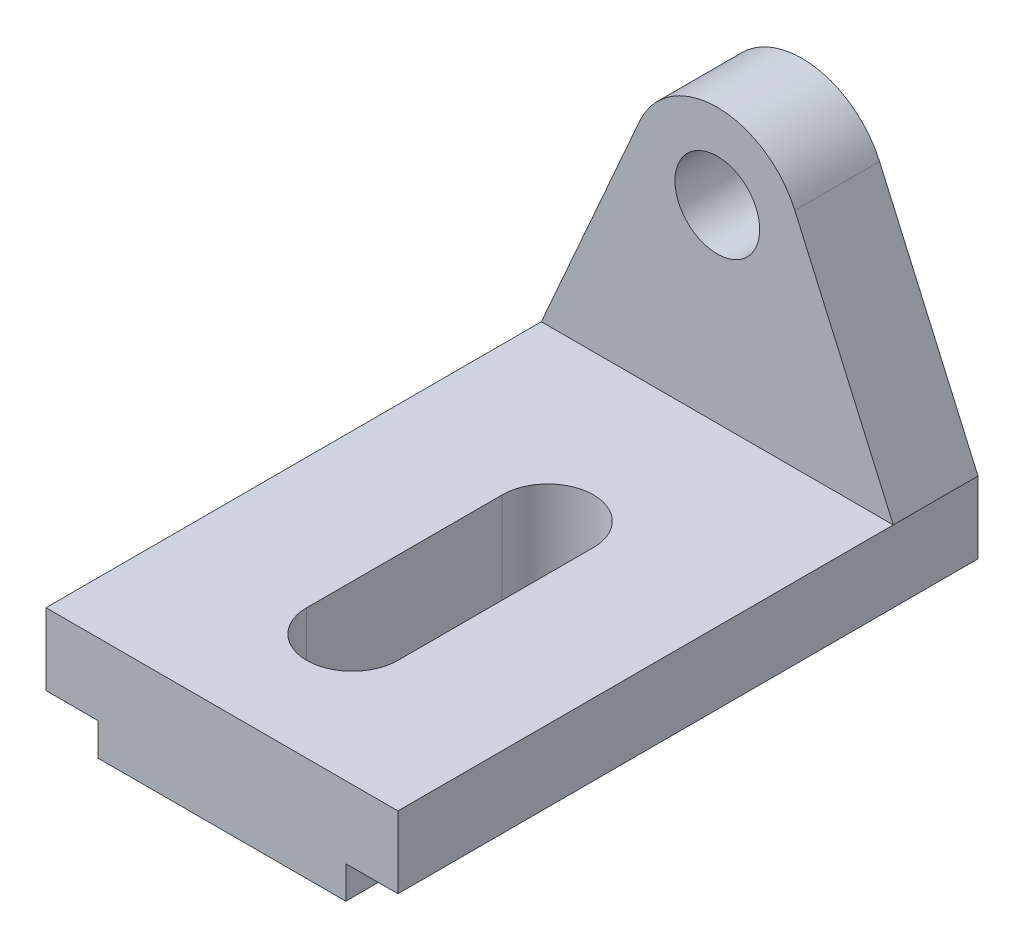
ISO-10303-21;
HEADER;
FILE_DESCRIPTION(('STEP AP214'),'2;1');
FILE_NAME('part.step','',(''),(''),'','','');
FILE_SCHEMA(('AUTOMOTIVE_DESIGN { 1 0 10303 214 1 1 1 1 }'));
ENDSEC;
DATA;
#1=APPLICATION_CONTEXT('core data for automotive mechanical design processes');
#2=APPLICATION_PROTOCOL_DEFINITION('international standard','automotive_design',2000,#1);
#3=PRODUCT_CONTEXT('',#1,'mechanical');
#4=PRODUCT('Part','Part','',(#3));
#5=PRODUCT_RELATED_PRODUCT_CATEGORY('part','',(#4));
#6=PRODUCT_DEFINITION_FORMATION('','',#4);
#7=PRODUCT_DEFINITION_CONTEXT('part definition',#1,'design');
#8=PRODUCT_DEFINITION('design','',#6,#7);
#9=PRODUCT_DEFINITION_SHAPE('','',#8);
#10=(LENGTH_UNIT() NAMED_UNIT(*) SI_UNIT(.MILLI.,.METRE.));
#11=(NAMED_UNIT(*) PLANE_ANGLE_UNIT() SI_UNIT($,.RADIAN.));
#12=(NAMED_UNIT(*) SI_UNIT($,.STERADIAN.) SOLID_ANGLE_UNIT());
#13=UNCERTAINTY_MEASURE_WITH_UNIT(LENGTH_MEASURE(1.E-05),#10,'distance_accuracy_value','');
#14=(GEOMETRIC_REPRESENTATION_CONTEXT(3) GLOBAL_UNCERTAINTY_ASSIGNED_CONTEXT((#13)) GLOBAL_UNIT_ASSIGNED_CONTEXT((#10,
#11,#12)) REPRESENTATION_CONTEXT('',''));
#15=CARTESIAN_POINT('',(0.,0.,0.));
#16=DIRECTION('',(0.,0.,1.));
#17=DIRECTION('',(1.,0.,0.));
#18=AXIS2_PLACEMENT_3D('',#15,#16,#17);
#19=CARTESIAN_POINT('',(0.,0.,89.));
#20=DIRECTION('',(0.,-1.,0.));
#21=DIRECTION('',(0.,0.,-1.));
#22=AXIS2_PLACEMENT_3D('',#19,#20,#21);
#23=PLANE('',#22);
#24=CARTESIAN_POINT('',(27.,0.,69.));
#25=DIRECTION('',(0.,1.,0.));
#26=DIRECTION('',(0.,0.,1.));
#27=AXIS2_PLACEMENT_3D('',#24,#25,#26);
#28=CIRCLE('',#27,7.00000000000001);
#29=CARTESIAN_POINT('',(20.,0.,69.));
#30=VERTEX_POINT('',#29);
#31=CARTESIAN_POINT('',(34.,0.,69.));
#32=VERTEX_POINT('',#31);
#33=EDGE_CURVE('E162',#30,#32,#28,.T.);
#34=ORIENTED_EDGE('',*,*,#33,.F.);
#35=DIRECTION('',(0.,0.,1.));
#36=VECTOR('',#35,1.);
#37=CARTESIAN_POINT('',(20.,0.,0.));
#38=LINE('',#37,#36);
#39=CARTESIAN_POINT('',(20.,0.,39.));
#40=VERTEX_POINT('',#39);
#41=EDGE_CURVE('E58',#40,#30,#38,.T.);
#42=ORIENTED_EDGE('',*,*,#41,.F.);
#43=CARTESIAN_POINT('',(27.,0.,39.));
#44=DIRECTION('',(0.,1.,0.));
#45=DIRECTION('',(0.,0.,1.));
#46=AXIS2_PLACEMENT_3D('',#43,#44,#45);
#47=CIRCLE('',#46,7.);
#48=CARTESIAN_POINT('',(34.,0.,39.));
#49=VERTEX_POINT('',#48);
#50=EDGE_CURVE('E168',#49,#40,#47,.T.);
#51=ORIENTED_EDGE('',*,*,#50,.F.);
#52=DIRECTION('',(0.,0.,1.));
#53=VECTOR('',#52,1.);
#54=CARTESIAN_POINT('',(34.,0.,0.));
#55=LINE('',#54,#53);
#56=EDGE_CURVE('E153',#49,#32,#55,.T.);
#57=ORIENTED_EDGE('',*,*,#56,.T.);
#58=EDGE_LOOP('',(#34,#42,#51,#57));
#59=FACE_BOUND('',#58,.T.);
#60=DIRECTION('',(1.,0.,0.));
#61=VECTOR('',#60,1.);
#62=CARTESIAN_POINT('',(0.,0.,13.));
#63=LINE('',#62,#61);
#64=CARTESIAN_POINT('',(0.,0.,13.));
#65=VERTEX_POINT('',#64);
#66=CARTESIAN_POINT('',(54.,0.,13.));
#67=VERTEX_POINT('',#66);
#68=EDGE_CURVE('E185',#65,#67,#63,.T.);
#69=ORIENTED_EDGE('',*,*,#68,.F.);
#70=DIRECTION('',(0.,0.,-1.));
#71=VECTOR('',#70,1.);
#72=CARTESIAN_POINT('',(0.,0.,89.));
#73=LINE('',#72,#71);
#74=CARTESIAN_POINT('',(0.,0.,89.));
#75=VERTEX_POINT('',#74);
#76=EDGE_CURVE('E262',#75,#65,#73,.T.);
#77=ORIENTED_EDGE('',*,*,#76,.F.);
#78=DIRECTION('',(-1.,0.,0.));
#79=VECTOR('',#78,1.);
#80=CARTESIAN_POINT('',(0.,0.,89.));
#81=LINE('',#80,#79);
#82=CARTESIAN_POINT('',(54.,0.,89.));
#83=VERTEX_POINT('',#82);
#84=EDGE_CURVE('E260',#83,#75,#81,.T.);
#85=ORIENTED_EDGE('',*,*,#84,.F.);
#86=DIRECTION('',(0.,0.,-1.));
#87=VECTOR('',#86,1.);
#88=CARTESIAN_POINT('',(54.,0.,89.));
#89=LINE('',#88,#87);
#90=EDGE_CURVE('E271',#83,#67,#89,.T.);
#91=ORIENTED_EDGE('',*,*,#90,.T.);
#92=EDGE_LOOP('',(#69,#77,#85,#91));
#93=FACE_BOUND('',#92,.T.);
#94=ADVANCED_FACE('F43',(#59,#93),#23,.F.);
#95=CARTESIAN_POINT('',(0.,-16.,89.));
#96=DIRECTION('',(0.,1.,0.));
#97=DIRECTION('',(0.,0.,1.));
#98=AXIS2_PLACEMENT_3D('',#95,#96,#97);
#99=PLANE('',#98);
#100=CARTESIAN_POINT('',(27.,-16.,39.));
#101=DIRECTION('',(0.,1.,0.));
#102=DIRECTION('',(0.,0.,1.));
#103=AXIS2_PLACEMENT_3D('',#100,#101,#102);
#104=CIRCLE('',#103,7.);
#105=CARTESIAN_POINT('',(34.,-16.,39.));
#106=VERTEX_POINT('',#105);
#107=CARTESIAN_POINT('',(20.,-16.,39.));
#108=VERTEX_POINT('',#107);
#109=EDGE_CURVE('E51',#106,#108,#104,.T.);
#110=ORIENTED_EDGE('',*,*,#109,.T.);
#111=DIRECTION('',(0.,0.,1.));
#112=VECTOR('',#111,1.);
#113=CARTESIAN_POINT('',(20.,-16.,89.));
#114=LINE('',#113,#112);
#115=CARTESIAN_POINT('',(20.,-16.,69.));
#116=VERTEX_POINT('',#115);
#117=EDGE_CURVE('E11',#108,#116,#114,.T.);
#118=ORIENTED_EDGE('',*,*,#117,.T.);
#119=CARTESIAN_POINT('',(27.,-16.,69.));
#120=DIRECTION('',(0.,1.,0.));
#121=DIRECTION('',(0.,0.,1.));
#122=AXIS2_PLACEMENT_3D('',#119,#120,#121);
#123=CIRCLE('',#122,7.00000000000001);
#124=CARTESIAN_POINT('',(34.,-16.,69.));
#125=VERTEX_POINT('',#124);
#126=EDGE_CURVE('E273',#116,#125,#123,.T.);
#127=ORIENTED_EDGE('',*,*,#126,.T.);
#128=DIRECTION('',(0.,0.,1.));
#129=VECTOR('',#128,1.);
#130=CARTESIAN_POINT('',(34.,-16.,89.));
#131=LINE('',#130,#129);
#132=EDGE_CURVE('E156',#106,#125,#131,.T.);
#133=ORIENTED_EDGE('',*,*,#132,.F.);
#134=EDGE_LOOP('',(#110,#118,#127,#133));
#135=FACE_BOUND('',#134,.T.);
#136=DIRECTION('',(1.,0.,0.));
#137=VECTOR('',#136,1.);
#138=CARTESIAN_POINT('',(0.,-16.,89.));
#139=LINE('',#138,#137);
#140=CARTESIAN_POINT('',(8.,-16.,89.));
#141=VERTEX_POINT('',#140);
#142=CARTESIAN_POINT('',(46.,-16.,89.));
#143=VERTEX_POINT('',#142);
#144=EDGE_CURVE('E254',#141,#143,#139,.T.);
#145=ORIENTED_EDGE('',*,*,#144,.F.);
#146=DIRECTION('',(0.,0.,1.));
#147=VECTOR('',#146,1.);
#148=CARTESIAN_POINT('',(8.,-16.,0.));
#149=LINE('',#148,#147);
#150=CARTESIAN_POINT('',(8.,-16.,0.));
#151=VERTEX_POINT('',#150);
#152=EDGE_CURVE('E221',#151,#141,#149,.T.);
#153=ORIENTED_EDGE('',*,*,#152,.F.);
#154=DIRECTION('',(1.,0.,0.));
#155=VECTOR('',#154,1.);
#156=CARTESIAN_POINT('',(0.,-16.,0.));
#157=LINE('',#156,#155);
#158=CARTESIAN_POINT('',(46.,-16.,0.));
#159=VERTEX_POINT('',#158);
#160=EDGE_CURVE('E265',#151,#159,#157,.T.);
#161=ORIENTED_EDGE('',*,*,#160,.T.);
#162=DIRECTION('',(0.,0.,1.));
#163=VECTOR('',#162,1.);
#164=CARTESIAN_POINT('',(46.,-16.,0.));
#165=LINE('',#164,#163);
#166=EDGE_CURVE('E240',#159,#143,#165,.T.);
#167=ORIENTED_EDGE('',*,*,#166,.T.);
#168=EDGE_LOOP('',(#145,#153,#161,#167));
#169=FACE_BOUND('',#168,.T.);
#170=ADVANCED_FACE('F277',(#135,#169),#99,.F.);
#171=CARTESIAN_POINT('',(54.,0.,89.));
#172=DIRECTION('',(-1.,0.,0.));
#173=DIRECTION('',(0.,-1.,0.));
#174=AXIS2_PLACEMENT_3D('',#171,#172,#173);
#175=PLANE('',#174);
#176=DIRECTION('',(0.,0.,1.));
#177=VECTOR('',#176,1.);
#178=CARTESIAN_POINT('',(54.,-11.0111974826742,0.));
#179=LINE('',#178,#177);
#180=CARTESIAN_POINT('',(54.,-11.0111974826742,0.));
#181=VERTEX_POINT('',#180);
#182=CARTESIAN_POINT('',(54.,-11.0111974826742,89.));
#183=VERTEX_POINT('',#182);
#184=EDGE_CURVE('E247',#181,#183,#179,.T.);
#185=ORIENTED_EDGE('',*,*,#184,.F.);
#186=DIRECTION('',(0.,1.,0.));
#187=VECTOR('',#186,1.);
#188=CARTESIAN_POINT('',(54.,0.,0.));
#189=LINE('',#188,#187);
#190=CARTESIAN_POINT('',(54.,0.,0.));
#191=VERTEX_POINT('',#190);
#192=EDGE_CURVE('E255',#181,#191,#189,.T.);
#193=ORIENTED_EDGE('',*,*,#192,.T.);
#194=DIRECTION('',(0.,0.,-1.));
#195=VECTOR('',#194,1.);
#196=CARTESIAN_POINT('',(54.,0.,13.));
#197=LINE('',#196,#195);
#198=EDGE_CURVE('E194',#67,#191,#197,.T.);
#199=ORIENTED_EDGE('',*,*,#198,.F.);
#200=ORIENTED_EDGE('',*,*,#90,.F.);
#201=DIRECTION('',(0.,1.,0.));
#202=VECTOR('',#201,1.);
#203=CARTESIAN_POINT('',(54.,0.,89.));
#204=LINE('',#203,#202);
#205=EDGE_CURVE('E258',#183,#83,#204,.T.);
#206=ORIENTED_EDGE('',*,*,#205,.F.);
#207=EDGE_LOOP('',(#185,#193,#199,#200,#206));
#208=FACE_BOUND('',#207,.T.);
#209=ADVANCED_FACE('F301',(#208),#175,.F.);
#210=CARTESIAN_POINT('',(0.,0.,89.));
#211=DIRECTION('',(0.,0.,1.));
#212=DIRECTION('',(1.,0.,0.));
#213=AXIS2_PLACEMENT_3D('',#210,#211,#212);
#214=PLANE('',#213);
#215=DIRECTION('',(-1.,0.,0.));
#216=VECTOR('',#215,1.);
#217=CARTESIAN_POINT('',(0.,-11.0111974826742,89.));
#218=LINE('',#217,#216);
#219=CARTESIAN_POINT('',(8.,-11.0111974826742,89.));
#220=VERTEX_POINT('',#219);
#221=CARTESIAN_POINT('',(0.,-11.0111974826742,89.));
#222=VERTEX_POINT('',#221);
#223=EDGE_CURVE('E218',#220,#222,#218,.T.);
#224=ORIENTED_EDGE('',*,*,#223,.F.);
#225=DIRECTION('',(0.,1.,0.));
#226=VECTOR('',#225,1.);
#227=CARTESIAN_POINT('',(8.,0.,89.));
#228=LINE('',#227,#226);
#229=EDGE_CURVE('E222',#141,#220,#228,.T.);
#230=ORIENTED_EDGE('',*,*,#229,.F.);
#231=ORIENTED_EDGE('',*,*,#144,.T.);
#232=DIRECTION('',(0.,1.,0.));
#233=VECTOR('',#232,1.);
#234=CARTESIAN_POINT('',(46.,0.,89.));
#235=LINE('',#234,#233);
#236=CARTESIAN_POINT('',(46.,-11.0111974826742,89.));
#237=VERTEX_POINT('',#236);
#238=EDGE_CURVE('E207',#143,#237,#235,.T.);
#239=ORIENTED_EDGE('',*,*,#238,.T.);
#240=DIRECTION('',(1.,0.,0.));
#241=VECTOR('',#240,1.);
#242=CARTESIAN_POINT('',(0.,-11.0111974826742,89.));
#243=LINE('',#242,#241);
#244=EDGE_CURVE('E238',#237,#183,#243,.T.);
#245=ORIENTED_EDGE('',*,*,#244,.T.);
#246=ORIENTED_EDGE('',*,*,#205,.T.);
#247=ORIENTED_EDGE('',*,*,#84,.T.);
#248=DIRECTION('',(0.,-1.,0.));
#249=VECTOR('',#248,1.);
#250=CARTESIAN_POINT('',(0.,0.,89.));
#251=LINE('',#250,#249);
#252=EDGE_CURVE('E251',#75,#222,#251,.T.);
#253=ORIENTED_EDGE('',*,*,#252,.T.);
#254=EDGE_LOOP('',(#224,#230,#231,#239,#245,#246,#247,#253));
#255=FACE_BOUND('',#254,.T.);
#256=ADVANCED_FACE('F307',(#255),#214,.T.);
#257=CARTESIAN_POINT('',(0.,0.,0.));
#258=DIRECTION('',(0.,0.,1.));
#259=DIRECTION('',(1.,0.,0.));
#260=AXIS2_PLACEMENT_3D('',#257,#258,#259);
#261=PLANE('',#260);
#262=DIRECTION('',(0.,1.,0.));
#263=VECTOR('',#262,1.);
#264=CARTESIAN_POINT('',(8.,0.,0.));
#265=LINE('',#264,#263);
#266=CARTESIAN_POINT('',(8.,-11.0111974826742,0.));
#267=VERTEX_POINT('',#266);
#268=EDGE_CURVE('E214',#151,#267,#265,.T.);
#269=ORIENTED_EDGE('',*,*,#268,.T.);
#270=DIRECTION('',(-1.,0.,0.));
#271=VECTOR('',#270,1.);
#272=CARTESIAN_POINT('',(0.,-11.0111974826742,0.));
#273=LINE('',#272,#271);
#274=CARTESIAN_POINT('',(0.,-11.0111974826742,0.));
#275=VERTEX_POINT('',#274);
#276=EDGE_CURVE('E217',#267,#275,#273,.T.);
#277=ORIENTED_EDGE('',*,*,#276,.T.);
#278=DIRECTION('',(0.,-1.,0.));
#279=VECTOR('',#278,1.);
#280=CARTESIAN_POINT('',(0.,0.,0.));
#281=LINE('',#280,#279);
#282=CARTESIAN_POINT('',(0.,0.,0.));
#283=VERTEX_POINT('',#282);
#284=EDGE_CURVE('E230',#283,#275,#281,.T.);
#285=ORIENTED_EDGE('',*,*,#284,.F.);
#286=DIRECTION('',(0.403572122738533,0.91494783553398,0.));
#287=VECTOR('',#286,1.);
#288=CARTESIAN_POINT('',(0.,0.,0.));
#289=LINE('',#288,#287);
#290=CARTESIAN_POINT('',(15.1056781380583,34.2464375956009,0.));
#291=VERTEX_POINT('',#290);
#292=EDGE_CURVE('E200',#283,#291,#289,.T.);
#293=ORIENTED_EDGE('',*,*,#292,.T.);
#294=CARTESIAN_POINT('',(27.,29.,0.));
#295=DIRECTION('',(0.,0.,-1.));
#296=DIRECTION('',(-1.,0.,0.));
#297=AXIS2_PLACEMENT_3D('',#294,#295,#296);
#298=CIRCLE('',#297,13.);
#299=CARTESIAN_POINT('',(38.8943218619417,34.2464375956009,0.));
#300=VERTEX_POINT('',#299);
#301=EDGE_CURVE('E182',#291,#300,#298,.T.);
#302=ORIENTED_EDGE('',*,*,#301,.T.);
#303=DIRECTION('',(0.403572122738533,-0.91494783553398,0.));
#304=VECTOR('',#303,1.);
#305=CARTESIAN_POINT('',(45.204995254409,19.9393617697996,0.));
#306=LINE('',#305,#304);
#307=EDGE_CURVE('E197',#300,#191,#306,.T.);
#308=ORIENTED_EDGE('',*,*,#307,.T.);
#309=ORIENTED_EDGE('',*,*,#192,.F.);
#310=DIRECTION('',(1.,0.,0.));
#311=VECTOR('',#310,1.);
#312=CARTESIAN_POINT('',(0.,-11.0111974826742,0.));
#313=LINE('',#312,#311);
#314=CARTESIAN_POINT('',(46.,-11.0111974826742,0.));
#315=VERTEX_POINT('',#314);
#316=EDGE_CURVE('E237',#315,#181,#313,.T.);
#317=ORIENTED_EDGE('',*,*,#316,.F.);
#318=DIRECTION('',(0.,1.,0.));
#319=VECTOR('',#318,1.);
#320=CARTESIAN_POINT('',(46.,0.,0.));
#321=LINE('',#320,#319);
#322=EDGE_CURVE('E234',#159,#315,#321,.T.);
#323=ORIENTED_EDGE('',*,*,#322,.F.);
#324=ORIENTED_EDGE('',*,*,#160,.F.);
#325=EDGE_LOOP('',(#269,#277,#285,#293,#302,#308,#309,#317,#323,#324));
#326=FACE_BOUND('',#325,.T.);
#327=CARTESIAN_POINT('',(27.,29.,0.));
#328=DIRECTION('',(0.,0.,-1.));
#329=DIRECTION('',(-1.,0.,0.));
#330=AXIS2_PLACEMENT_3D('',#327,#328,#329);
#331=CIRCLE('',#330,6.5);
#332=CARTESIAN_POINT('',(20.5,29.,0.));
#333=VERTEX_POINT('',#332);
#334=EDGE_CURVE('E175',#333,#333,#331,.T.);
#335=ORIENTED_EDGE('',*,*,#334,.F.);
#336=EDGE_LOOP('',(#335));
#337=FACE_BOUND('',#336,.T.);
#338=ADVANCED_FACE('F304',(#326,#337),#261,.F.);
#339=CARTESIAN_POINT('',(0.,0.,89.));
#340=DIRECTION('',(1.,0.,0.));
#341=DIRECTION('',(0.,0.,-1.));
#342=AXIS2_PLACEMENT_3D('',#339,#340,#341);
#343=PLANE('',#342);
#344=ORIENTED_EDGE('',*,*,#284,.T.);
#345=DIRECTION('',(0.,0.,1.));
#346=VECTOR('',#345,1.);
#347=CARTESIAN_POINT('',(0.,-11.0111974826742,0.));
#348=LINE('',#347,#346);
#349=EDGE_CURVE('E227',#275,#222,#348,.T.);
#350=ORIENTED_EDGE('',*,*,#349,.T.);
#351=ORIENTED_EDGE('',*,*,#252,.F.);
#352=ORIENTED_EDGE('',*,*,#76,.T.);
#353=DIRECTION('',(0.,0.,-1.));
#354=VECTOR('',#353,1.);
#355=CARTESIAN_POINT('',(0.,0.,13.));
#356=LINE('',#355,#354);
#357=EDGE_CURVE('E210',#65,#283,#356,.T.);
#358=ORIENTED_EDGE('',*,*,#357,.T.);
#359=EDGE_LOOP('',(#344,#350,#351,#352,#358));
#360=FACE_BOUND('',#359,.T.);
#361=ADVANCED_FACE('F45',(#360),#343,.F.);
#362=CARTESIAN_POINT('',(46.,0.,0.));
#363=DIRECTION('',(1.,0.,0.));
#364=DIRECTION('',(0.,0.,-1.));
#365=AXIS2_PLACEMENT_3D('',#362,#363,#364);
#366=PLANE('',#365);
#367=ORIENTED_EDGE('',*,*,#238,.F.);
#368=ORIENTED_EDGE('',*,*,#166,.F.);
#369=ORIENTED_EDGE('',*,*,#322,.T.);
#370=DIRECTION('',(0.,0.,1.));
#371=VECTOR('',#370,1.);
#372=CARTESIAN_POINT('',(46.,-11.0111974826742,0.));
#373=LINE('',#372,#371);
#374=EDGE_CURVE('E225',#315,#237,#373,.T.);
#375=ORIENTED_EDGE('',*,*,#374,.T.);
#376=EDGE_LOOP('',(#367,#368,#369,#375));
#377=FACE_BOUND('',#376,.T.);
#378=ADVANCED_FACE('F367',(#377),#366,.T.);
#379=CARTESIAN_POINT('',(0.,-11.0111974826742,0.));
#380=DIRECTION('',(0.,-1.,0.));
#381=DIRECTION('',(0.,0.,-1.));
#382=AXIS2_PLACEMENT_3D('',#379,#380,#381);
#383=PLANE('',#382);
#384=ORIENTED_EDGE('',*,*,#244,.F.);
#385=ORIENTED_EDGE('',*,*,#374,.F.);
#386=ORIENTED_EDGE('',*,*,#316,.T.);
#387=ORIENTED_EDGE('',*,*,#184,.T.);
#388=EDGE_LOOP('',(#384,#385,#386,#387));
#389=FACE_BOUND('',#388,.T.);
#390=ADVANCED_FACE('F360',(#389),#383,.T.);
#391=CARTESIAN_POINT('',(0.,-11.0111974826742,0.));
#392=DIRECTION('',(0.,1.,0.));
#393=DIRECTION('',(0.,0.,1.));
#394=AXIS2_PLACEMENT_3D('',#391,#392,#393);
#395=PLANE('',#394);
#396=ORIENTED_EDGE('',*,*,#223,.T.);
#397=ORIENTED_EDGE('',*,*,#349,.F.);
#398=ORIENTED_EDGE('',*,*,#276,.F.);
#399=DIRECTION('',(0.,0.,1.));
#400=VECTOR('',#399,1.);
#401=CARTESIAN_POINT('',(8.,-11.0111974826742,0.));
#402=LINE('',#401,#400);
#403=EDGE_CURVE('E231',#267,#220,#402,.T.);
#404=ORIENTED_EDGE('',*,*,#403,.T.);
#405=EDGE_LOOP('',(#396,#397,#398,#404));
#406=FACE_BOUND('',#405,.T.);
#407=ADVANCED_FACE('F357',(#406),#395,.F.);
#408=CARTESIAN_POINT('',(8.,0.,0.));
#409=DIRECTION('',(1.,0.,0.));
#410=DIRECTION('',(0.,0.,-1.));
#411=AXIS2_PLACEMENT_3D('',#408,#409,#410);
#412=PLANE('',#411);
#413=ORIENTED_EDGE('',*,*,#229,.T.);
#414=ORIENTED_EDGE('',*,*,#403,.F.);
#415=ORIENTED_EDGE('',*,*,#268,.F.);
#416=ORIENTED_EDGE('',*,*,#152,.T.);
#417=EDGE_LOOP('',(#413,#414,#415,#416));
#418=FACE_BOUND('',#417,.T.);
#419=ADVANCED_FACE('F351',(#418),#412,.F.);
#420=CARTESIAN_POINT('',(45.204995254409,19.9393617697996,13.));
#421=DIRECTION('',(0.91494783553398,0.403572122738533,0.));
#422=DIRECTION('',(-0.403572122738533,0.91494783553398,0.));
#423=AXIS2_PLACEMENT_3D('',#420,#421,#422);
#424=PLANE('',#423);
#425=ORIENTED_EDGE('',*,*,#307,.F.);
#426=DIRECTION('',(0.,0.,-1.));
#427=VECTOR('',#426,1.);
#428=CARTESIAN_POINT('',(38.8943218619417,34.2464375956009,13.));
#429=LINE('',#428,#427);
#430=CARTESIAN_POINT('',(38.8943218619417,34.2464375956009,13.));
#431=VERTEX_POINT('',#430);
#432=EDGE_CURVE('E205',#431,#300,#429,.T.);
#433=ORIENTED_EDGE('',*,*,#432,.F.);
#434=DIRECTION('',(0.403572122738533,-0.91494783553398,0.));
#435=VECTOR('',#434,1.);
#436=CARTESIAN_POINT('',(45.204995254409,19.9393617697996,13.));
#437=LINE('',#436,#435);
#438=EDGE_CURVE('E181',#431,#67,#437,.T.);
#439=ORIENTED_EDGE('',*,*,#438,.T.);
#440=ORIENTED_EDGE('',*,*,#198,.T.);
#441=EDGE_LOOP('',(#425,#433,#439,#440));
#442=FACE_BOUND('',#441,.T.);
#443=ADVANCED_FACE('F328',(#442),#424,.T.);
#444=CARTESIAN_POINT('',(27.,29.,13.));
#445=DIRECTION('',(0.,0.,-1.));
#446=DIRECTION('',(-1.,0.,0.));
#447=AXIS2_PLACEMENT_3D('',#444,#445,#446);
#448=CYLINDRICAL_SURFACE('',#447,13.);
#449=ORIENTED_EDGE('',*,*,#301,.F.);
#450=DIRECTION('',(0.,0.,-1.));
#451=VECTOR('',#450,1.);
#452=CARTESIAN_POINT('',(15.1056781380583,34.2464375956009,13.));
#453=LINE('',#452,#451);
#454=CARTESIAN_POINT('',(15.1056781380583,34.2464375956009,13.));
#455=VERTEX_POINT('',#454);
#456=EDGE_CURVE('E208',#455,#291,#453,.T.);
#457=ORIENTED_EDGE('',*,*,#456,.F.);
#458=CARTESIAN_POINT('',(27.,29.,13.));
#459=DIRECTION('',(0.,0.,-1.));
#460=DIRECTION('',(-1.,0.,0.));
#461=AXIS2_PLACEMENT_3D('',#458,#459,#460);
#462=CIRCLE('',#461,13.);
#463=EDGE_CURVE('E191',#455,#431,#462,.T.);
#464=ORIENTED_EDGE('',*,*,#463,.T.);
#465=ORIENTED_EDGE('',*,*,#432,.T.);
#466=EDGE_LOOP('',(#449,#457,#464,#465));
#467=FACE_BOUND('',#466,.T.);
#468=ADVANCED_FACE('F343',(#467),#448,.T.);
#469=CARTESIAN_POINT('',(0.,0.,13.));
#470=DIRECTION('',(-0.91494783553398,0.403572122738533,0.));
#471=DIRECTION('',(-0.403572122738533,-0.91494783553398,0.));
#472=AXIS2_PLACEMENT_3D('',#469,#470,#471);
#473=PLANE('',#472);
#474=ORIENTED_EDGE('',*,*,#292,.F.);
#475=ORIENTED_EDGE('',*,*,#357,.F.);
#476=DIRECTION('',(0.403572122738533,0.91494783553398,0.));
#477=VECTOR('',#476,1.);
#478=CARTESIAN_POINT('',(0.,0.,13.));
#479=LINE('',#478,#477);
#480=EDGE_CURVE('E188',#65,#455,#479,.T.);
#481=ORIENTED_EDGE('',*,*,#480,.T.);
#482=ORIENTED_EDGE('',*,*,#456,.T.);
#483=EDGE_LOOP('',(#474,#475,#481,#482));
#484=FACE_BOUND('',#483,.T.);
#485=ADVANCED_FACE('F341',(#484),#473,.T.);
#486=CARTESIAN_POINT('',(27.,29.,13.));
#487=DIRECTION('',(0.,0.,-1.));
#488=DIRECTION('',(-1.,0.,0.));
#489=AXIS2_PLACEMENT_3D('',#486,#487,#488);
#490=CYLINDRICAL_SURFACE('',#489,6.5);
#491=CARTESIAN_POINT('',(27.,29.,13.));
#492=DIRECTION('',(0.,0.,-1.));
#493=DIRECTION('',(-1.,0.,0.));
#494=AXIS2_PLACEMENT_3D('',#491,#492,#493);
#495=CIRCLE('',#494,6.5);
#496=CARTESIAN_POINT('',(20.5,29.,13.));
#497=VERTEX_POINT('',#496);
#498=EDGE_CURVE('E178',#497,#497,#495,.T.);
#499=CARTESIAN_POINT('',(20.5,29.,13.));
#500=CARTESIAN_POINT('',(20.5,29.,12.8645833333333));
#501=CARTESIAN_POINT('',(20.5,29.,12.7291666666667));
#502=CARTESIAN_POINT('',(20.5,29.,12.4583333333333));
#503=CARTESIAN_POINT('',(20.5,29.,12.3229166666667));
#504=CARTESIAN_POINT('',(20.5,29.,12.0520833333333));
#505=CARTESIAN_POINT('',(20.5,29.,11.9166666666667));
#506=CARTESIAN_POINT('',(20.5,29.,11.6458333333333));
#507=CARTESIAN_POINT('',(20.5,29.,11.5104166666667));
#508=CARTESIAN_POINT('',(20.5,29.,11.2395833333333));
#509=CARTESIAN_POINT('',(20.5,29.,11.1041666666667));
#510=CARTESIAN_POINT('',(20.5,29.,10.8333333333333));
#511=CARTESIAN_POINT('',(20.5,29.,10.6979166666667));
#512=CARTESIAN_POINT('',(20.5,29.,10.4270833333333));
#513=CARTESIAN_POINT('',(20.5,29.,10.2916666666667));
#514=CARTESIAN_POINT('',(20.5,29.,10.0208333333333));
#515=CARTESIAN_POINT('',(20.5,29.,9.88541666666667));
#516=CARTESIAN_POINT('',(20.5,29.,9.61458333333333));
#517=CARTESIAN_POINT('',(20.5,29.,9.47916666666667));
#518=CARTESIAN_POINT('',(20.5,29.,9.20833333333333));
#519=CARTESIAN_POINT('',(20.5,29.,9.07291666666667));
#520=CARTESIAN_POINT('',(20.5,29.,8.80208333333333));
#521=CARTESIAN_POINT('',(20.5,29.,8.66666666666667));
#522=CARTESIAN_POINT('',(20.5,29.,8.39583333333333));
#523=CARTESIAN_POINT('',(20.5,29.,8.26041666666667));
#524=CARTESIAN_POINT('',(20.5,29.,7.98958333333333));
#525=CARTESIAN_POINT('',(20.5,29.,7.85416666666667));
#526=CARTESIAN_POINT('',(20.5,29.,7.58333333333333));
#527=CARTESIAN_POINT('',(20.5,29.,7.44791666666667));
#528=CARTESIAN_POINT('',(20.5,29.,7.17708333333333));
#529=CARTESIAN_POINT('',(20.5,29.,7.04166666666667));
#530=CARTESIAN_POINT('',(20.5,29.,6.77083333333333));
#531=CARTESIAN_POINT('',(20.5,29.,6.63541666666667));
#532=CARTESIAN_POINT('',(20.5,29.,6.36458333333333));
#533=CARTESIAN_POINT('',(20.5,29.,6.22916666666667));
#534=CARTESIAN_POINT('',(20.5,29.,5.95833333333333));
#535=CARTESIAN_POINT('',(20.5,29.,5.82291666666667));
#536=CARTESIAN_POINT('',(20.5,29.,5.55208333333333));
#537=CARTESIAN_POINT('',(20.5,29.,5.41666666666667));
#538=CARTESIAN_POINT('',(20.5,29.,5.14583333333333));
#539=CARTESIAN_POINT('',(20.5,29.,5.01041666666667));
#540=CARTESIAN_POINT('',(20.5,29.,4.73958333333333));
#541=CARTESIAN_POINT('',(20.5,29.,4.60416666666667));
#542=CARTESIAN_POINT('',(20.5,29.,4.33333333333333));
#543=CARTESIAN_POINT('',(20.5,29.,4.19791666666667));
#544=CARTESIAN_POINT('',(20.5,29.,3.92708333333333));
#545=CARTESIAN_POINT('',(20.5,29.,3.79166666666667));
#546=CARTESIAN_POINT('',(20.5,29.,3.52083333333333));
#547=CARTESIAN_POINT('',(20.5,29.,3.38541666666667));
#548=CARTESIAN_POINT('',(20.5,29.,3.11458333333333));
#549=CARTESIAN_POINT('',(20.5,29.,2.97916666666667));
#550=CARTESIAN_POINT('',(20.5,29.,2.70833333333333));
#551=CARTESIAN_POINT('',(20.5,29.,2.57291666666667));
#552=CARTESIAN_POINT('',(20.5,29.,2.30208333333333));
#553=CARTESIAN_POINT('',(20.5,29.,2.16666666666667));
#554=CARTESIAN_POINT('',(20.5,29.,1.89583333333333));
#555=CARTESIAN_POINT('',(20.5,29.,1.76041666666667));
#556=CARTESIAN_POINT('',(20.5,29.,1.48958333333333));
#557=CARTESIAN_POINT('',(20.5,29.,1.35416666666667));
#558=CARTESIAN_POINT('',(20.5,29.,1.08333333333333));
#559=CARTESIAN_POINT('',(20.5,29.,0.947916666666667));
#560=CARTESIAN_POINT('',(20.5,29.,0.677083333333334));
#561=CARTESIAN_POINT('',(20.5,29.,0.541666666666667));
#562=CARTESIAN_POINT('',(20.5,29.,0.270833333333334));
#563=CARTESIAN_POINT('',(20.5,29.,0.135416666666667));
#564=CARTESIAN_POINT('',(20.5,29.,0.));
#565=B_SPLINE_CURVE_WITH_KNOTS('',3,(#499,#500,#501,#502,#503,#504,#505,#506,#507,#508,#509,
#510,#511,#512,#513,#514,#515,#516,#517,#518,#519,#520,#521,#522,#523,#524,#525,#526,#527,#528,
#529,#530,#531,#532,#533,#534,#535,#536,#537,#538,#539,#540,#541,#542,#543,#544,#545,#546,#547,
#548,#549,#550,#551,#552,#553,#554,#555,#556,#557,#558,#559,#560,#561,#562,#563,#564),
.UNSPECIFIED.,.F.,.F.,(4,2,2,2,2,2,2,2,2,2,2,2,2,2,2,2,2,2,2,2,2,2,2,2,2,2,2,2,2,2,2,2,4),(0.,
0.40625,0.812500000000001,1.21875,1.625,2.03125,2.4375,2.84375,3.25,3.65625,4.0625,4.46875,
4.875,5.28125,5.6875,6.09375,6.5,6.90625,7.3125,7.71875,8.125,8.53125,8.9375,9.34375,9.75,
10.15625,10.5625,10.96875,11.375,11.78125,12.1875,12.59375,13.),.UNSPECIFIED.);
#566=EDGE_CURVE('BSEAM291',#497,#333,#565,.T.);
#567=ORIENTED_EDGE('',*,*,#498,.F.);
#568=ORIENTED_EDGE('',*,*,#334,.T.);
#569=ORIENTED_EDGE('',*,*,#566,.T.);
#570=ORIENTED_EDGE('',*,*,#566,.F.);
#571=EDGE_LOOP('',(#567,#569,#568,#570));
#572=FACE_BOUND('',#571,.T.);
#573=ADVANCED_FACE('F291',(#572),#490,.F.);
#574=CARTESIAN_POINT('',(0.,0.,13.));
#575=DIRECTION('',(0.,0.,-1.));
#576=DIRECTION('',(-1.,0.,0.));
#577=AXIS2_PLACEMENT_3D('',#574,#575,#576);
#578=PLANE('',#577);
#579=ORIENTED_EDGE('',*,*,#498,.T.);
#580=EDGE_LOOP('',(#579));
#581=FACE_BOUND('',#580,.T.);
#582=ORIENTED_EDGE('',*,*,#438,.F.);
#583=ORIENTED_EDGE('',*,*,#463,.F.);
#584=ORIENTED_EDGE('',*,*,#480,.F.);
#585=ORIENTED_EDGE('',*,*,#68,.T.);
#586=EDGE_LOOP('',(#582,#583,#584,#585));
#587=FACE_BOUND('',#586,.T.);
#588=ADVANCED_FACE('F284',(#581,#587),#578,.F.);
#589=CARTESIAN_POINT('',(20.,-27.,0.));
#590=DIRECTION('',(-1.,0.,0.));
#591=DIRECTION('',(0.,0.,1.));
#592=AXIS2_PLACEMENT_3D('',#589,#590,#591);
#593=PLANE('',#592);
#594=DIRECTION('',(0.,1.,0.));
#595=VECTOR('',#594,1.);
#596=CARTESIAN_POINT('',(20.,-27.,39.));
#597=LINE('',#596,#595);
#598=EDGE_CURVE('E173',#108,#40,#597,.T.);
#599=ORIENTED_EDGE('',*,*,#598,.T.);
#600=ORIENTED_EDGE('',*,*,#41,.T.);
#601=DIRECTION('',(0.,1.,0.));
#602=VECTOR('',#601,1.);
#603=CARTESIAN_POINT('',(20.,-27.,69.));
#604=LINE('',#603,#602);
#605=EDGE_CURVE('E159',#116,#30,#604,.T.);
#606=ORIENTED_EDGE('',*,*,#605,.F.);
#607=ORIENTED_EDGE('',*,*,#117,.F.);
#608=EDGE_LOOP('',(#599,#600,#606,#607));
#609=FACE_BOUND('',#608,.T.);
#610=ADVANCED_FACE('F282',(#609),#593,.F.);
#611=CARTESIAN_POINT('',(27.,-27.,39.));
#612=DIRECTION('',(0.,1.,0.));
#613=DIRECTION('',(0.,0.,1.));
#614=AXIS2_PLACEMENT_3D('',#611,#612,#613);
#615=CYLINDRICAL_SURFACE('',#614,7.);
#616=DIRECTION('',(0.,1.,0.));
#617=VECTOR('',#616,1.);
#618=CARTESIAN_POINT('',(34.,-27.,39.));
#619=LINE('',#618,#617);
#620=EDGE_CURVE('E158',#106,#49,#619,.T.);
#621=ORIENTED_EDGE('',*,*,#620,.T.);
#622=ORIENTED_EDGE('',*,*,#50,.T.);
#623=ORIENTED_EDGE('',*,*,#598,.F.);
#624=ORIENTED_EDGE('',*,*,#109,.F.);
#625=EDGE_LOOP('',(#621,#622,#623,#624));
#626=FACE_BOUND('',#625,.T.);
#627=ADVANCED_FACE('F281',(#626),#615,.F.);
#628=CARTESIAN_POINT('',(34.,-27.,0.));
#629=DIRECTION('',(-1.,0.,0.));
#630=DIRECTION('',(0.,0.,1.));
#631=AXIS2_PLACEMENT_3D('',#628,#629,#630);
#632=PLANE('',#631);
#633=ORIENTED_EDGE('',*,*,#132,.T.);
#634=DIRECTION('',(0.,1.,0.));
#635=VECTOR('',#634,1.);
#636=CARTESIAN_POINT('',(34.,-27.,69.));
#637=LINE('',#636,#635);
#638=EDGE_CURVE('E66',#125,#32,#637,.T.);
#639=ORIENTED_EDGE('',*,*,#638,.T.);
#640=ORIENTED_EDGE('',*,*,#56,.F.);
#641=ORIENTED_EDGE('',*,*,#620,.F.);
#642=EDGE_LOOP('',(#633,#639,#640,#641));
#643=FACE_BOUND('',#642,.T.);
#644=ADVANCED_FACE('F150',(#643),#632,.T.);
#645=CARTESIAN_POINT('',(27.,-27.,69.));
#646=DIRECTION('',(0.,1.,0.));
#647=DIRECTION('',(0.,0.,1.));
#648=AXIS2_PLACEMENT_3D('',#645,#646,#647);
#649=CYLINDRICAL_SURFACE('',#648,7.00000000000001);
#650=ORIENTED_EDGE('',*,*,#605,.T.);
#651=ORIENTED_EDGE('',*,*,#33,.T.);
#652=ORIENTED_EDGE('',*,*,#638,.F.);
#653=ORIENTED_EDGE('',*,*,#126,.F.);
#654=EDGE_LOOP('',(#650,#651,#652,#653));
#655=FACE_BOUND('',#654,.T.);
#656=ADVANCED_FACE('F163',(#655),#649,.F.);
#657=CLOSED_SHELL('',(#94,#170,#209,#256,#338,#361,#378,#390,#407,#419,#443,#468,#485,#573,#588,
#610,#627,#644,#656));
#658=MANIFOLD_SOLID_BREP('B2',#657);
#659=ADVANCED_BREP_SHAPE_REPRESENTATION('',(#18,#658),#14);
#660=SHAPE_DEFINITION_REPRESENTATION(#9,#659);
ENDSEC;
END-ISO-10303-21;
